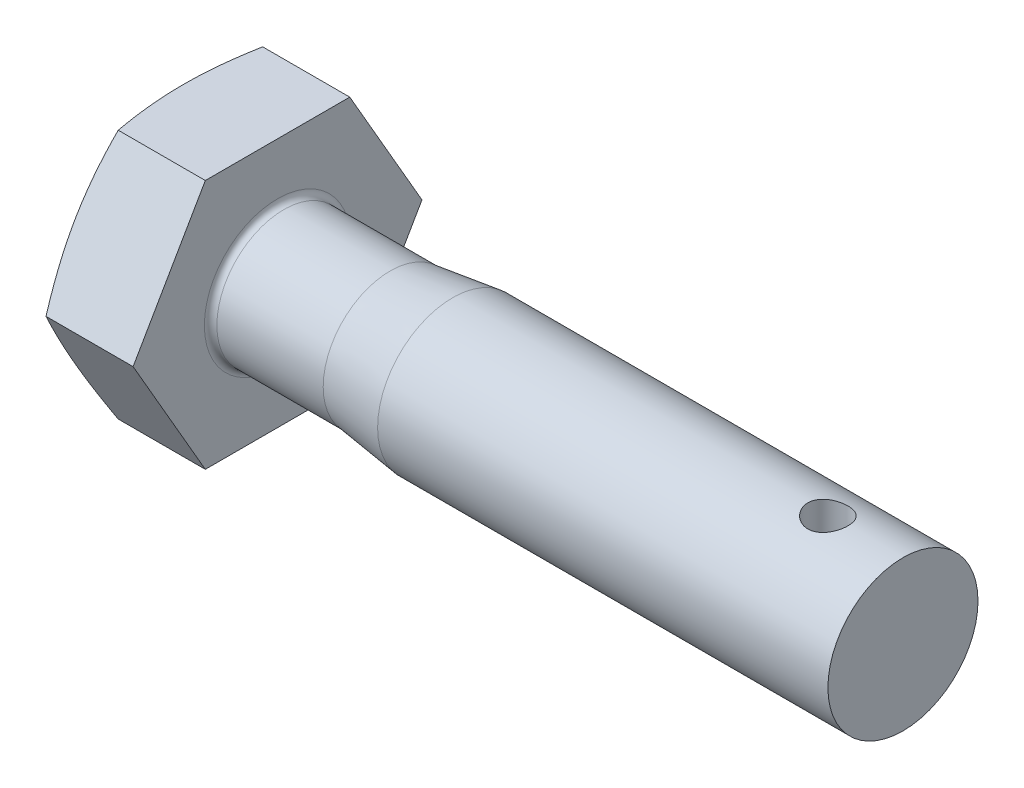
from build123d import *

# Parameters (mm, degrees)
BASEHEAD_DEPTH     = 4
SKETCH2_R          = 3
BASEBODY_DEPTH     = 25
SKETCH4_R          = 3.4
CUT_EXTRUDE1_DEPTH = 0.8
HEADFILLET_R       = 0.25
HOLE_DEPTH         = 30.988886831
HOLE_DEPTH_BACK    = 30.988886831
SKETCH6_R          = 0.8


with BuildPart() as part:
    # Sketch1 → BaseHead (new body)
    with BuildSketch(Plane(origin=(0, 0, 0), x_dir=(0, 0, -1), z_dir=(1, 0, 0))):
        Polygon((2.886751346, -5), (5.773502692, 0), (2.886751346, 5), (-2.886751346, 5), (-5.773502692, 0), (-2.886751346, -5), align=None)
    extrude(amount=BASEHEAD_DEPTH)

    # Sketch2 → BaseBody (add)
    with BuildSketch(Plane(origin=(4, 0, 0), x_dir=(0, 0, -1), z_dir=(1, 0, 0))):
        with Locations(Location((0, 0, 0), (0, 0, 180))):
            Circle(SKETCH2_R)
    extrude(amount=BASEBODY_DEPTH)

    # Sketch3 → HeadChamfer (revolve, cut)
    with BuildSketch(Plane(origin=(3.161211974, 0, 2.612290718), x_dir=(0, 0, -1), z_dir=(0, 1, 0)), mode=Mode.PRIVATE) as headchamfer_sk:
        Polygon((8.38579341, 3.161211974), (8.38579341, 2.643099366), (6.962290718, 3.161211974), align=None)
    revolve(headchamfer_sk.sketch.rotate(Axis((1.089857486, 0, 0), (1, 0, 0)), 180), axis=Axis((1.089857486, 0, 0), (1, 0, 0)), mode=Mode.SUBTRACT)

    # Sketch4 → Cut-Extrude1 (cut)
    with BuildSketch(Plane(origin=(0, 0, 0), x_dir=(0, 0, -1), z_dir=(1, 0, 0))):
        Circle(SKETCH4_R)
    extrude(amount=CUT_EXTRUDE1_DEPTH, mode=Mode.SUBTRACT)

    # Sketch5 → Cut-Revolve1 (revolve, cut)
    with BuildSketch(Plane(origin=(-2.92963122, 0, 7.92963122), x_dir=(0, 0, -1), z_dir=(0, 1, 0)), mode=Mode.PRIVATE) as cut_revolve1_sk:
        Polygon((10.92963122, -13.92963122), (10.60463122, -11.42963122), (10.60463122, -6.92963122), (13.27963122, -6.92963122), (13.27963122, -13.92963122), align=None)
    revolve(cut_revolve1_sk.sketch.rotate(Axis((0, 0, 0), (1, 0, 0)), 180), axis=Axis((0, 0, 0), (1, 0, 0)), mode=Mode.SUBTRACT)

    # HeadFillet
    headfillet_edges = [part.edges().sort_by_distance(p)[0] for p in [
        (4, 0, -2.675),
    ]]
    fillet(headfillet_edges, radius=HEADFILLET_R)

    # Sketch6 → Hole (cut, two sides: drawn at the far end of the back side and taken through both)
    with BuildSketch(Plane(origin=(0, 0, 0), x_dir=(1, 0, 0), z_dir=(0, 1, 0)).offset(-HOLE_DEPTH_BACK)):
        with Locations(Location((26, 0, 0), (0, 0, 270))):
            Circle(SKETCH6_R)
    extrude(amount=HOLE_DEPTH + HOLE_DEPTH_BACK, mode=Mode.SUBTRACT)


solid = part.part
